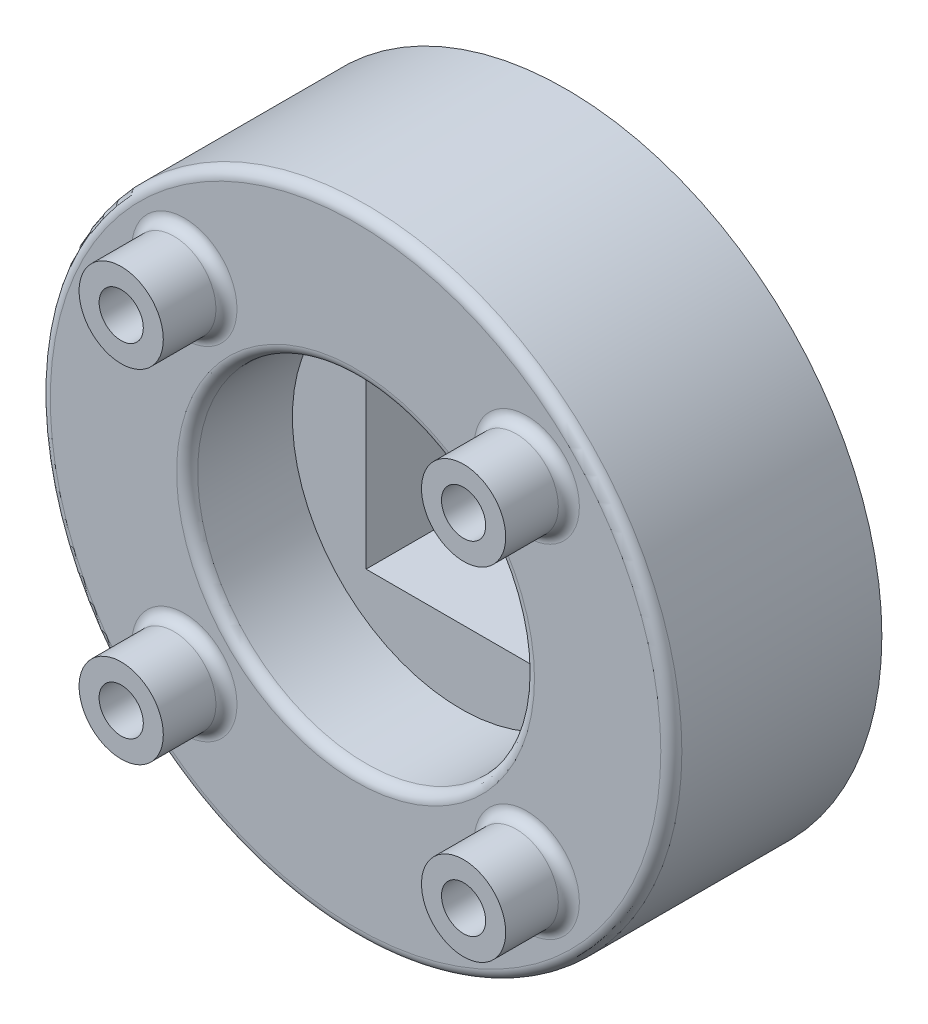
ISO-10303-21;
HEADER;
FILE_DESCRIPTION(('STEP AP214'),'2;1');
FILE_NAME('part.step','',(''),(''),'','','');
FILE_SCHEMA(('AUTOMOTIVE_DESIGN { 1 0 10303 214 1 1 1 1 }'));
ENDSEC;
DATA;
#1=APPLICATION_CONTEXT('core data for automotive mechanical design processes');
#2=APPLICATION_PROTOCOL_DEFINITION('international standard','automotive_design',2000,#1);
#3=PRODUCT_CONTEXT('',#1,'mechanical');
#4=PRODUCT('Part','Part','',(#3));
#5=PRODUCT_RELATED_PRODUCT_CATEGORY('part','',(#4));
#6=PRODUCT_DEFINITION_FORMATION('','',#4);
#7=PRODUCT_DEFINITION_CONTEXT('part definition',#1,'design');
#8=PRODUCT_DEFINITION('design','',#6,#7);
#9=PRODUCT_DEFINITION_SHAPE('','',#8);
#10=(LENGTH_UNIT() NAMED_UNIT(*) SI_UNIT(.MILLI.,.METRE.));
#11=(NAMED_UNIT(*) PLANE_ANGLE_UNIT() SI_UNIT($,.RADIAN.));
#12=(NAMED_UNIT(*) SI_UNIT($,.STERADIAN.) SOLID_ANGLE_UNIT());
#13=UNCERTAINTY_MEASURE_WITH_UNIT(LENGTH_MEASURE(1.E-05),#10,'distance_accuracy_value','');
#14=(GEOMETRIC_REPRESENTATION_CONTEXT(3) GLOBAL_UNCERTAINTY_ASSIGNED_CONTEXT((#13)) GLOBAL_UNIT_ASSIGNED_CONTEXT((#10,
#11,#12)) REPRESENTATION_CONTEXT('',''));
#15=CARTESIAN_POINT('',(0.,0.,0.));
#16=DIRECTION('',(0.,0.,1.));
#17=DIRECTION('',(1.,0.,0.));
#18=AXIS2_PLACEMENT_3D('',#15,#16,#17);
#19=CARTESIAN_POINT('',(22.5,-22.5,0.));
#20=DIRECTION('',(1.,0.,0.));
#21=DIRECTION('',(0.,0.,-1.));
#22=AXIS2_PLACEMENT_3D('',#19,#20,#21);
#23=PLANE('',#22);
#24=DIRECTION('',(0.,-1.,0.));
#25=VECTOR('',#24,1.);
#26=CARTESIAN_POINT('',(22.5,-22.5,25.));
#27=LINE('',#26,#25);
#28=CARTESIAN_POINT('',(22.5,22.5,25.));
#29=VERTEX_POINT('',#28);
#30=CARTESIAN_POINT('',(22.5,-22.5,25.));
#31=VERTEX_POINT('',#30);
#32=EDGE_CURVE('E143',#29,#31,#27,.T.);
#33=ORIENTED_EDGE('',*,*,#32,.F.);
#34=DIRECTION('',(0.,0.,1.));
#35=VECTOR('',#34,1.);
#36=CARTESIAN_POINT('',(22.5,22.5,0.));
#37=LINE('',#36,#35);
#38=CARTESIAN_POINT('',(22.5,22.5,0.));
#39=VERTEX_POINT('',#38);
#40=EDGE_CURVE('E155',#39,#29,#37,.T.);
#41=ORIENTED_EDGE('',*,*,#40,.F.);
#42=DIRECTION('',(0.,1.,0.));
#43=VECTOR('',#42,1.);
#44=CARTESIAN_POINT('',(22.5,-22.5,0.));
#45=LINE('',#44,#43);
#46=CARTESIAN_POINT('',(22.5,-22.5,0.));
#47=VERTEX_POINT('',#46);
#48=EDGE_CURVE('E145',#47,#39,#45,.T.);
#49=ORIENTED_EDGE('',*,*,#48,.F.);
#50=DIRECTION('',(0.,0.,1.));
#51=VECTOR('',#50,1.);
#52=CARTESIAN_POINT('',(22.5,-22.5,0.));
#53=LINE('',#52,#51);
#54=EDGE_CURVE('E156',#47,#31,#53,.T.);
#55=ORIENTED_EDGE('',*,*,#54,.T.);
#56=EDGE_LOOP('',(#33,#41,#49,#55));
#57=FACE_BOUND('',#56,.T.);
#58=ADVANCED_FACE('F40',(#57),#23,.F.);
#59=CARTESIAN_POINT('',(-22.5,-22.5,0.));
#60=DIRECTION('',(0.,-1.,0.));
#61=DIRECTION('',(0.,0.,-1.));
#62=AXIS2_PLACEMENT_3D('',#59,#60,#61);
#63=PLANE('',#62);
#64=DIRECTION('',(-1.,0.,0.));
#65=VECTOR('',#64,1.);
#66=CARTESIAN_POINT('',(-22.5,-22.5,25.));
#67=LINE('',#66,#65);
#68=CARTESIAN_POINT('',(-22.5,-22.5,25.));
#69=VERTEX_POINT('',#68);
#70=EDGE_CURVE('E141',#31,#69,#67,.T.);
#71=ORIENTED_EDGE('',*,*,#70,.F.);
#72=ORIENTED_EDGE('',*,*,#54,.F.);
#73=DIRECTION('',(1.,0.,0.));
#74=VECTOR('',#73,1.);
#75=CARTESIAN_POINT('',(-22.5,-22.5,0.));
#76=LINE('',#75,#74);
#77=CARTESIAN_POINT('',(-22.5,-22.5,0.));
#78=VERTEX_POINT('',#77);
#79=EDGE_CURVE('E152',#78,#47,#76,.T.);
#80=ORIENTED_EDGE('',*,*,#79,.F.);
#81=DIRECTION('',(0.,0.,1.));
#82=VECTOR('',#81,1.);
#83=CARTESIAN_POINT('',(-22.5,-22.5,0.));
#84=LINE('',#83,#82);
#85=EDGE_CURVE('E160',#78,#69,#84,.T.);
#86=ORIENTED_EDGE('',*,*,#85,.T.);
#87=EDGE_LOOP('',(#71,#72,#80,#86));
#88=FACE_BOUND('',#87,.T.);
#89=ADVANCED_FACE('F220',(#88),#63,.F.);
#90=CARTESIAN_POINT('',(-22.5,-22.5,0.));
#91=DIRECTION('',(-1.,0.,0.));
#92=DIRECTION('',(0.,0.,1.));
#93=AXIS2_PLACEMENT_3D('',#90,#91,#92);
#94=PLANE('',#93);
#95=DIRECTION('',(0.,1.,0.));
#96=VECTOR('',#95,1.);
#97=CARTESIAN_POINT('',(-22.5,-22.5,25.));
#98=LINE('',#97,#96);
#99=CARTESIAN_POINT('',(-22.5,22.5,25.));
#100=VERTEX_POINT('',#99);
#101=EDGE_CURVE('E55',#69,#100,#98,.T.);
#102=ORIENTED_EDGE('',*,*,#101,.F.);
#103=ORIENTED_EDGE('',*,*,#85,.F.);
#104=DIRECTION('',(0.,-1.,0.));
#105=VECTOR('',#104,1.);
#106=CARTESIAN_POINT('',(-22.5,-22.5,0.));
#107=LINE('',#106,#105);
#108=CARTESIAN_POINT('',(-22.5,22.5,0.));
#109=VERTEX_POINT('',#108);
#110=EDGE_CURVE('E63',#109,#78,#107,.T.);
#111=ORIENTED_EDGE('',*,*,#110,.F.);
#112=DIRECTION('',(0.,0.,1.));
#113=VECTOR('',#112,1.);
#114=CARTESIAN_POINT('',(-22.5,22.5,0.));
#115=LINE('',#114,#113);
#116=EDGE_CURVE('E163',#109,#100,#115,.T.);
#117=ORIENTED_EDGE('',*,*,#116,.T.);
#118=EDGE_LOOP('',(#102,#103,#111,#117));
#119=FACE_BOUND('',#118,.T.);
#120=ADVANCED_FACE('F226',(#119),#94,.F.);
#121=CARTESIAN_POINT('',(-22.5,22.5,0.));
#122=DIRECTION('',(0.,1.,0.));
#123=DIRECTION('',(0.,0.,1.));
#124=AXIS2_PLACEMENT_3D('',#121,#122,#123);
#125=PLANE('',#124);
#126=DIRECTION('',(1.,0.,0.));
#127=VECTOR('',#126,1.);
#128=CARTESIAN_POINT('',(-22.5,22.5,25.));
#129=LINE('',#128,#127);
#130=EDGE_CURVE('E169',#100,#29,#129,.T.);
#131=ORIENTED_EDGE('',*,*,#130,.F.);
#132=ORIENTED_EDGE('',*,*,#116,.F.);
#133=DIRECTION('',(-1.,0.,0.));
#134=VECTOR('',#133,1.);
#135=CARTESIAN_POINT('',(-22.5,22.5,0.));
#136=LINE('',#135,#134);
#137=EDGE_CURVE('E148',#39,#109,#136,.T.);
#138=ORIENTED_EDGE('',*,*,#137,.F.);
#139=ORIENTED_EDGE('',*,*,#40,.T.);
#140=EDGE_LOOP('',(#131,#132,#138,#139));
#141=FACE_BOUND('',#140,.T.);
#142=ADVANCED_FACE('F232',(#141),#125,.F.);
#143=CARTESIAN_POINT('',(0.,0.,50.));
#144=DIRECTION('',(0.,0.,-1.));
#145=DIRECTION('',(-1.,0.,0.));
#146=AXIS2_PLACEMENT_3D('',#143,#144,#145);
#147=CYLINDRICAL_SURFACE('',#146,75.);
#148=CARTESIAN_POINT('',(0.,0.,47.5));
#149=DIRECTION('',(0.,0.,1.));
#150=DIRECTION('',(1.,0.,0.));
#151=AXIS2_PLACEMENT_3D('',#148,#149,#150);
#152=CIRCLE('',#151,75.);
#153=CARTESIAN_POINT('',(75.,0.,47.5));
#154=VERTEX_POINT('',#153);
#155=EDGE_CURVE('E189',#154,#154,#152,.F.);
#156=ORIENTED_EDGE('',*,*,#155,.T.);
#157=EDGE_LOOP('',(#156));
#158=FACE_BOUND('',#157,.T.);
#159=CARTESIAN_POINT('',(0.,0.,0.));
#160=DIRECTION('',(0.,0.,1.));
#161=DIRECTION('',(1.,0.,0.));
#162=AXIS2_PLACEMENT_3D('',#159,#160,#161);
#163=CIRCLE('',#162,75.);
#164=CARTESIAN_POINT('',(75.,0.,0.));
#165=VERTEX_POINT('',#164);
#166=EDGE_CURVE('E159',#165,#165,#163,.T.);
#167=ORIENTED_EDGE('',*,*,#166,.T.);
#168=EDGE_LOOP('',(#167));
#169=FACE_BOUND('',#168,.T.);
#170=ADVANCED_FACE('F238',(#158,#169),#147,.T.);
#171=CARTESIAN_POINT('',(0.,0.,50.));
#172=DIRECTION('',(0.,0.,1.));
#173=DIRECTION('',(1.,0.,0.));
#174=AXIS2_PLACEMENT_3D('',#171,#172,#173);
#175=PLANE('',#174);
#176=CARTESIAN_POINT('',(0.,0.,50.));
#177=DIRECTION('',(0.,0.,1.));
#178=DIRECTION('',(1.,0.,0.));
#179=AXIS2_PLACEMENT_3D('',#176,#177,#178);
#180=CIRCLE('',#179,72.5);
#181=CARTESIAN_POINT('',(72.5,0.,50.));
#182=VERTEX_POINT('',#181);
#183=EDGE_CURVE('E186',#182,#182,#180,.T.);
#184=ORIENTED_EDGE('',*,*,#183,.T.);
#185=EDGE_LOOP('',(#184));
#186=FACE_BOUND('',#185,.T.);
#187=CARTESIAN_POINT('',(0.,0.,50.));
#188=DIRECTION('',(0.,0.,1.));
#189=DIRECTION('',(1.,0.,0.));
#190=AXIS2_PLACEMENT_3D('',#187,#188,#189);
#191=CIRCLE('',#190,42.5);
#192=CARTESIAN_POINT('',(42.5,0.,50.));
#193=VERTEX_POINT('',#192);
#194=EDGE_CURVE('E183',#193,#193,#191,.F.);
#195=ORIENTED_EDGE('',*,*,#194,.T.);
#196=EDGE_LOOP('',(#195));
#197=FACE_BOUND('',#196,.T.);
#198=CARTESIAN_POINT('',(-40.6586399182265,40.6586399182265,50.));
#199=DIRECTION('',(0.,0.,1.));
#200=DIRECTION('',(1.,0.,0.));
#201=AXIS2_PLACEMENT_3D('',#198,#199,#200);
#202=CIRCLE('',#201,12.5);
#203=CARTESIAN_POINT('',(-28.1586399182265,40.6586399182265,50.));
#204=VERTEX_POINT('',#203);
#205=EDGE_CURVE('E180',#204,#204,#202,.F.);
#206=ORIENTED_EDGE('',*,*,#205,.T.);
#207=EDGE_LOOP('',(#206));
#208=FACE_BOUND('',#207,.T.);
#209=CARTESIAN_POINT('',(40.6586399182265,40.6586399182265,50.));
#210=DIRECTION('',(0.,0.,1.));
#211=DIRECTION('',(1.,0.,0.));
#212=AXIS2_PLACEMENT_3D('',#209,#210,#211);
#213=CIRCLE('',#212,12.5);
#214=CARTESIAN_POINT('',(53.1586399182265,40.6586399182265,50.));
#215=VERTEX_POINT('',#214);
#216=EDGE_CURVE('E177',#215,#215,#213,.F.);
#217=ORIENTED_EDGE('',*,*,#216,.T.);
#218=EDGE_LOOP('',(#217));
#219=FACE_BOUND('',#218,.T.);
#220=CARTESIAN_POINT('',(40.6586399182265,-40.6586399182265,50.));
#221=DIRECTION('',(0.,0.,1.));
#222=DIRECTION('',(1.,0.,0.));
#223=AXIS2_PLACEMENT_3D('',#220,#221,#222);
#224=CIRCLE('',#223,12.5);
#225=CARTESIAN_POINT('',(53.1586399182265,-40.6586399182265,50.));
#226=VERTEX_POINT('',#225);
#227=EDGE_CURVE('E174',#226,#226,#224,.F.);
#228=ORIENTED_EDGE('',*,*,#227,.T.);
#229=EDGE_LOOP('',(#228));
#230=FACE_BOUND('',#229,.T.);
#231=CARTESIAN_POINT('',(-40.6586399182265,-40.6586399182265,50.));
#232=DIRECTION('',(0.,0.,1.));
#233=DIRECTION('',(1.,0.,0.));
#234=AXIS2_PLACEMENT_3D('',#231,#232,#233);
#235=CIRCLE('',#234,12.5);
#236=CARTESIAN_POINT('',(-28.1586399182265,-40.6586399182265,50.));
#237=VERTEX_POINT('',#236);
#238=EDGE_CURVE('E171',#237,#237,#235,.F.);
#239=ORIENTED_EDGE('',*,*,#238,.T.);
#240=EDGE_LOOP('',(#239));
#241=FACE_BOUND('',#240,.T.);
#242=ADVANCED_FACE('F234',(#186,#197,#208,#219,#230,#241),#175,.T.);
#243=CARTESIAN_POINT('',(0.,0.,0.));
#244=DIRECTION('',(0.,0.,1.));
#245=DIRECTION('',(1.,0.,0.));
#246=AXIS2_PLACEMENT_3D('',#243,#244,#245);
#247=PLANE('',#246);
#248=ORIENTED_EDGE('',*,*,#79,.T.);
#249=ORIENTED_EDGE('',*,*,#48,.T.);
#250=ORIENTED_EDGE('',*,*,#137,.T.);
#251=ORIENTED_EDGE('',*,*,#110,.T.);
#252=EDGE_LOOP('',(#248,#249,#250,#251));
#253=FACE_BOUND('',#252,.T.);
#254=ORIENTED_EDGE('',*,*,#166,.F.);
#255=EDGE_LOOP('',(#254));
#256=FACE_BOUND('',#255,.T.);
#257=ADVANCED_FACE('F237',(#253,#256),#247,.F.);
#258=CARTESIAN_POINT('',(0.,0.,25.));
#259=DIRECTION('',(0.,0.,1.));
#260=DIRECTION('',(1.,0.,0.));
#261=AXIS2_PLACEMENT_3D('',#258,#259,#260);
#262=PLANE('',#261);
#263=CARTESIAN_POINT('',(0.,0.,25.));
#264=DIRECTION('',(0.,0.,1.));
#265=DIRECTION('',(1.,0.,0.));
#266=AXIS2_PLACEMENT_3D('',#263,#264,#265);
#267=CIRCLE('',#266,40.);
#268=CARTESIAN_POINT('',(40.,0.,25.));
#269=VERTEX_POINT('',#268);
#270=EDGE_CURVE('E137',#269,#269,#267,.T.);
#271=ORIENTED_EDGE('',*,*,#270,.T.);
#272=EDGE_LOOP('',(#271));
#273=FACE_BOUND('',#272,.T.);
#274=ORIENTED_EDGE('',*,*,#32,.T.);
#275=ORIENTED_EDGE('',*,*,#70,.T.);
#276=ORIENTED_EDGE('',*,*,#101,.T.);
#277=ORIENTED_EDGE('',*,*,#130,.T.);
#278=EDGE_LOOP('',(#274,#275,#276,#277));
#279=FACE_BOUND('',#278,.T.);
#280=ADVANCED_FACE('F242',(#273,#279),#262,.T.);
#281=CARTESIAN_POINT('',(0.,0.,25.));
#282=DIRECTION('',(0.,0.,1.));
#283=DIRECTION('',(1.,0.,0.));
#284=AXIS2_PLACEMENT_3D('',#281,#282,#283);
#285=CYLINDRICAL_SURFACE('',#284,40.);
#286=CARTESIAN_POINT('',(0.,0.,47.5));
#287=DIRECTION('',(0.,0.,1.));
#288=DIRECTION('',(1.,0.,0.));
#289=AXIS2_PLACEMENT_3D('',#286,#287,#288);
#290=CIRCLE('',#289,40.);
#291=CARTESIAN_POINT('',(40.,0.,47.5));
#292=VERTEX_POINT('',#291);
#293=EDGE_CURVE('E192',#292,#292,#290,.T.);
#294=ORIENTED_EDGE('',*,*,#293,.T.);
#295=EDGE_LOOP('',(#294));
#296=FACE_BOUND('',#295,.T.);
#297=ORIENTED_EDGE('',*,*,#270,.F.);
#298=EDGE_LOOP('',(#297));
#299=FACE_BOUND('',#298,.T.);
#300=ADVANCED_FACE('F267',(#296,#299),#285,.F.);
#301=CARTESIAN_POINT('',(-40.6586399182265,40.6586399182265,65.));
#302=DIRECTION('',(0.,0.,-1.));
#303=DIRECTION('',(-1.,0.,0.));
#304=AXIS2_PLACEMENT_3D('',#301,#302,#303);
#305=CYLINDRICAL_SURFACE('',#304,10.);
#306=CARTESIAN_POINT('',(-40.6586399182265,40.6586399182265,52.5));
#307=DIRECTION('',(0.,0.,1.));
#308=DIRECTION('',(1.,0.,0.));
#309=AXIS2_PLACEMENT_3D('',#306,#307,#308);
#310=CIRCLE('',#309,10.);
#311=CARTESIAN_POINT('',(-30.6586399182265,40.6586399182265,52.5));
#312=VERTEX_POINT('',#311);
#313=EDGE_CURVE('E195',#312,#312,#310,.T.);
#314=ORIENTED_EDGE('',*,*,#313,.T.);
#315=EDGE_LOOP('',(#314));
#316=FACE_BOUND('',#315,.T.);
#317=CARTESIAN_POINT('',(-40.6586399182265,40.6586399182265,65.));
#318=DIRECTION('',(0.,0.,1.));
#319=DIRECTION('',(1.,0.,0.));
#320=AXIS2_PLACEMENT_3D('',#317,#318,#319);
#321=CIRCLE('',#320,10.);
#322=CARTESIAN_POINT('',(-30.6586399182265,40.6586399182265,65.));
#323=VERTEX_POINT('',#322);
#324=EDGE_CURVE('E134',#323,#323,#321,.T.);
#325=ORIENTED_EDGE('',*,*,#324,.F.);
#326=EDGE_LOOP('',(#325));
#327=FACE_BOUND('',#326,.T.);
#328=ADVANCED_FACE('F263',(#316,#327),#305,.T.);
#329=CARTESIAN_POINT('',(-40.6586399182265,40.6586399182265,65.));
#330=DIRECTION('',(0.,0.,1.));
#331=DIRECTION('',(1.,0.,0.));
#332=AXIS2_PLACEMENT_3D('',#329,#330,#331);
#333=PLANE('',#332);
#334=CARTESIAN_POINT('',(-40.6586399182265,40.6586399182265,65.));
#335=DIRECTION('',(0.,0.,1.));
#336=DIRECTION('',(1.,0.,0.));
#337=AXIS2_PLACEMENT_3D('',#334,#335,#336);
#338=CIRCLE('',#337,5.24999999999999);
#339=CARTESIAN_POINT('',(-35.4086399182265,40.6586399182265,65.));
#340=VERTEX_POINT('',#339);
#341=EDGE_CURVE('E103',#340,#340,#338,.T.);
#342=ORIENTED_EDGE('',*,*,#341,.F.);
#343=EDGE_LOOP('',(#342));
#344=FACE_BOUND('',#343,.T.);
#345=ORIENTED_EDGE('',*,*,#324,.T.);
#346=EDGE_LOOP('',(#345));
#347=FACE_BOUND('',#346,.T.);
#348=ADVANCED_FACE('F266',(#344,#347),#333,.T.);
#349=CARTESIAN_POINT('',(40.6586399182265,40.6586399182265,65.));
#350=DIRECTION('',(0.,0.,-1.));
#351=DIRECTION('',(-1.,0.,0.));
#352=AXIS2_PLACEMENT_3D('',#349,#350,#351);
#353=CYLINDRICAL_SURFACE('',#352,10.);
#354=CARTESIAN_POINT('',(40.6586399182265,40.6586399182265,52.5));
#355=DIRECTION('',(0.,0.,1.));
#356=DIRECTION('',(1.,0.,0.));
#357=AXIS2_PLACEMENT_3D('',#354,#355,#356);
#358=CIRCLE('',#357,10.);
#359=CARTESIAN_POINT('',(50.6586399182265,40.6586399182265,52.5));
#360=VERTEX_POINT('',#359);
#361=EDGE_CURVE('E198',#360,#360,#358,.T.);
#362=ORIENTED_EDGE('',*,*,#361,.T.);
#363=EDGE_LOOP('',(#362));
#364=FACE_BOUND('',#363,.T.);
#365=CARTESIAN_POINT('',(40.6586399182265,40.6586399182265,65.));
#366=DIRECTION('',(0.,0.,1.));
#367=DIRECTION('',(1.,0.,0.));
#368=AXIS2_PLACEMENT_3D('',#365,#366,#367);
#369=CIRCLE('',#368,10.);
#370=CARTESIAN_POINT('',(50.6586399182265,40.6586399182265,65.));
#371=VERTEX_POINT('',#370);
#372=EDGE_CURVE('E131',#371,#371,#369,.T.);
#373=ORIENTED_EDGE('',*,*,#372,.F.);
#374=EDGE_LOOP('',(#373));
#375=FACE_BOUND('',#374,.T.);
#376=ADVANCED_FACE('F272',(#364,#375),#353,.T.);
#377=CARTESIAN_POINT('',(40.6586399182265,40.6586399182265,65.));
#378=DIRECTION('',(0.,0.,1.));
#379=DIRECTION('',(1.,0.,0.));
#380=AXIS2_PLACEMENT_3D('',#377,#378,#379);
#381=PLANE('',#380);
#382=CARTESIAN_POINT('',(40.6586399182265,40.6586399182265,65.));
#383=DIRECTION('',(0.,0.,1.));
#384=DIRECTION('',(1.,0.,0.));
#385=AXIS2_PLACEMENT_3D('',#382,#383,#384);
#386=CIRCLE('',#385,5.24999999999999);
#387=CARTESIAN_POINT('',(45.9086399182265,40.6586399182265,65.));
#388=VERTEX_POINT('',#387);
#389=EDGE_CURVE('E102',#388,#388,#386,.T.);
#390=ORIENTED_EDGE('',*,*,#389,.F.);
#391=EDGE_LOOP('',(#390));
#392=FACE_BOUND('',#391,.T.);
#393=ORIENTED_EDGE('',*,*,#372,.T.);
#394=EDGE_LOOP('',(#393));
#395=FACE_BOUND('',#394,.T.);
#396=ADVANCED_FACE('F278',(#392,#395),#381,.T.);
#397=CARTESIAN_POINT('',(40.6586399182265,-40.6586399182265,65.));
#398=DIRECTION('',(0.,0.,-1.));
#399=DIRECTION('',(-1.,0.,0.));
#400=AXIS2_PLACEMENT_3D('',#397,#398,#399);
#401=CYLINDRICAL_SURFACE('',#400,10.);
#402=CARTESIAN_POINT('',(40.6586399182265,-40.6586399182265,52.5));
#403=DIRECTION('',(0.,0.,1.));
#404=DIRECTION('',(1.,0.,0.));
#405=AXIS2_PLACEMENT_3D('',#402,#403,#404);
#406=CIRCLE('',#405,10.);
#407=CARTESIAN_POINT('',(50.6586399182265,-40.6586399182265,52.5));
#408=VERTEX_POINT('',#407);
#409=EDGE_CURVE('E48',#408,#408,#406,.T.);
#410=ORIENTED_EDGE('',*,*,#409,.T.);
#411=EDGE_LOOP('',(#410));
#412=FACE_BOUND('',#411,.T.);
#413=CARTESIAN_POINT('',(40.6586399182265,-40.6586399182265,65.));
#414=DIRECTION('',(0.,0.,1.));
#415=DIRECTION('',(1.,0.,0.));
#416=AXIS2_PLACEMENT_3D('',#413,#414,#415);
#417=CIRCLE('',#416,10.);
#418=CARTESIAN_POINT('',(50.6586399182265,-40.6586399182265,65.));
#419=VERTEX_POINT('',#418);
#420=EDGE_CURVE('E128',#419,#419,#417,.T.);
#421=ORIENTED_EDGE('',*,*,#420,.F.);
#422=EDGE_LOOP('',(#421));
#423=FACE_BOUND('',#422,.T.);
#424=ADVANCED_FACE('F203',(#412,#423),#401,.T.);
#425=CARTESIAN_POINT('',(40.6586399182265,-40.6586399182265,65.));
#426=DIRECTION('',(0.,0.,1.));
#427=DIRECTION('',(1.,0.,0.));
#428=AXIS2_PLACEMENT_3D('',#425,#426,#427);
#429=PLANE('',#428);
#430=CARTESIAN_POINT('',(40.6586399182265,-40.6586399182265,65.));
#431=DIRECTION('',(0.,0.,1.));
#432=DIRECTION('',(1.,0.,0.));
#433=AXIS2_PLACEMENT_3D('',#430,#431,#432);
#434=CIRCLE('',#433,5.24999999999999);
#435=CARTESIAN_POINT('',(45.9086399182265,-40.6586399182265,65.));
#436=VERTEX_POINT('',#435);
#437=EDGE_CURVE('E113',#436,#436,#434,.T.);
#438=ORIENTED_EDGE('',*,*,#437,.F.);
#439=EDGE_LOOP('',(#438));
#440=FACE_BOUND('',#439,.T.);
#441=ORIENTED_EDGE('',*,*,#420,.T.);
#442=EDGE_LOOP('',(#441));
#443=FACE_BOUND('',#442,.T.);
#444=ADVANCED_FACE('F346',(#440,#443),#429,.T.);
#445=CARTESIAN_POINT('',(-40.6586399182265,-40.6586399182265,65.));
#446=DIRECTION('',(0.,0.,-1.));
#447=DIRECTION('',(-1.,0.,0.));
#448=AXIS2_PLACEMENT_3D('',#445,#446,#447);
#449=CYLINDRICAL_SURFACE('',#448,10.);
#450=CARTESIAN_POINT('',(-40.6586399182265,-40.6586399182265,52.5));
#451=DIRECTION('',(0.,0.,1.));
#452=DIRECTION('',(1.,0.,0.));
#453=AXIS2_PLACEMENT_3D('',#450,#451,#452);
#454=CIRCLE('',#453,10.);
#455=CARTESIAN_POINT('',(-30.6586399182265,-40.6586399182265,52.5));
#456=VERTEX_POINT('',#455);
#457=EDGE_CURVE('E11',#456,#456,#454,.T.);
#458=ORIENTED_EDGE('',*,*,#457,.T.);
#459=EDGE_LOOP('',(#458));
#460=FACE_BOUND('',#459,.T.);
#461=CARTESIAN_POINT('',(-40.6586399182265,-40.6586399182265,65.));
#462=DIRECTION('',(0.,0.,1.));
#463=DIRECTION('',(1.,0.,0.));
#464=AXIS2_PLACEMENT_3D('',#461,#462,#463);
#465=CIRCLE('',#464,10.);
#466=CARTESIAN_POINT('',(-30.6586399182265,-40.6586399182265,65.));
#467=VERTEX_POINT('',#466);
#468=EDGE_CURVE('E125',#467,#467,#465,.T.);
#469=ORIENTED_EDGE('',*,*,#468,.F.);
#470=EDGE_LOOP('',(#469));
#471=FACE_BOUND('',#470,.T.);
#472=ADVANCED_FACE('F353',(#460,#471),#449,.T.);
#473=CARTESIAN_POINT('',(-40.6586399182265,-40.6586399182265,65.));
#474=DIRECTION('',(0.,0.,1.));
#475=DIRECTION('',(1.,0.,0.));
#476=AXIS2_PLACEMENT_3D('',#473,#474,#475);
#477=PLANE('',#476);
#478=CARTESIAN_POINT('',(-40.6586399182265,-40.6586399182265,65.));
#479=DIRECTION('',(0.,0.,1.));
#480=DIRECTION('',(1.,0.,0.));
#481=AXIS2_PLACEMENT_3D('',#478,#479,#480);
#482=CIRCLE('',#481,5.24999999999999);
#483=CARTESIAN_POINT('',(-35.4086399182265,-40.6586399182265,65.));
#484=VERTEX_POINT('',#483);
#485=EDGE_CURVE('E119',#484,#484,#482,.T.);
#486=ORIENTED_EDGE('',*,*,#485,.F.);
#487=EDGE_LOOP('',(#486));
#488=FACE_BOUND('',#487,.T.);
#489=ORIENTED_EDGE('',*,*,#468,.T.);
#490=EDGE_LOOP('',(#489));
#491=FACE_BOUND('',#490,.T.);
#492=ADVANCED_FACE('F358',(#488,#491),#477,.T.);
#493=CARTESIAN_POINT('',(-40.6586399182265,-40.6586399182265,33.5));
#494=DIRECTION('',(0.,0.,1.));
#495=DIRECTION('',(1.,0.,0.));
#496=AXIS2_PLACEMENT_3D('',#493,#494,#495);
#497=CONICAL_SURFACE('',#496,5.24999999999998,1.02974425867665);
#498=CARTESIAN_POINT('',(-40.6586399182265,-40.6586399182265,30.3454817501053));
#499=VERTEX_POINT('',#498);
#500=VERTEX_LOOP('',#499);
#501=FACE_BOUND('',#500,.T.);
#502=CARTESIAN_POINT('',(-40.6586399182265,-40.6586399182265,33.5));
#503=DIRECTION('',(0.,0.,1.));
#504=DIRECTION('',(1.,0.,0.));
#505=AXIS2_PLACEMENT_3D('',#502,#503,#504);
#506=CIRCLE('',#505,5.24999999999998);
#507=CARTESIAN_POINT('',(-35.4086399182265,-40.6586399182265,33.5));
#508=VERTEX_POINT('',#507);
#509=EDGE_CURVE('E122',#508,#508,#506,.T.);
#510=ORIENTED_EDGE('',*,*,#509,.T.);
#511=EDGE_LOOP('',(#510));
#512=FACE_BOUND('',#511,.T.);
#513=ADVANCED_FACE('F447',(#501,#512),#497,.F.);
#514=CARTESIAN_POINT('',(-40.6586399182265,-40.6586399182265,65.));
#515=DIRECTION('',(0.,0.,1.));
#516=DIRECTION('',(1.,0.,0.));
#517=AXIS2_PLACEMENT_3D('',#514,#515,#516);
#518=CYLINDRICAL_SURFACE('',#517,5.24999999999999);
#519=ORIENTED_EDGE('',*,*,#509,.F.);
#520=EDGE_LOOP('',(#519));
#521=FACE_BOUND('',#520,.T.);
#522=ORIENTED_EDGE('',*,*,#485,.T.);
#523=EDGE_LOOP('',(#522));
#524=FACE_BOUND('',#523,.T.);
#525=ADVANCED_FACE('F439',(#521,#524),#518,.F.);
#526=CARTESIAN_POINT('',(40.6586399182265,-40.6586399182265,33.5));
#527=DIRECTION('',(0.,0.,1.));
#528=DIRECTION('',(1.,0.,0.));
#529=AXIS2_PLACEMENT_3D('',#526,#527,#528);
#530=CONICAL_SURFACE('',#529,5.24999999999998,1.02974425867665);
#531=CARTESIAN_POINT('',(40.6586399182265,-40.6586399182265,30.3454817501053));
#532=VERTEX_POINT('',#531);
#533=VERTEX_LOOP('',#532);
#534=FACE_BOUND('',#533,.T.);
#535=CARTESIAN_POINT('',(40.6586399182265,-40.6586399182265,33.5));
#536=DIRECTION('',(0.,0.,1.));
#537=DIRECTION('',(1.,0.,0.));
#538=AXIS2_PLACEMENT_3D('',#535,#536,#537);
#539=CIRCLE('',#538,5.24999999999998);
#540=CARTESIAN_POINT('',(45.9086399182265,-40.6586399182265,33.5));
#541=VERTEX_POINT('',#540);
#542=EDGE_CURVE('E116',#541,#541,#539,.T.);
#543=ORIENTED_EDGE('',*,*,#542,.T.);
#544=EDGE_LOOP('',(#543));
#545=FACE_BOUND('',#544,.T.);
#546=ADVANCED_FACE('F430',(#534,#545),#530,.F.);
#547=CARTESIAN_POINT('',(40.6586399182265,-40.6586399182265,65.));
#548=DIRECTION('',(0.,0.,1.));
#549=DIRECTION('',(1.,0.,0.));
#550=AXIS2_PLACEMENT_3D('',#547,#548,#549);
#551=CYLINDRICAL_SURFACE('',#550,5.24999999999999);
#552=ORIENTED_EDGE('',*,*,#542,.F.);
#553=EDGE_LOOP('',(#552));
#554=FACE_BOUND('',#553,.T.);
#555=ORIENTED_EDGE('',*,*,#437,.T.);
#556=EDGE_LOOP('',(#555));
#557=FACE_BOUND('',#556,.T.);
#558=ADVANCED_FACE('F422',(#554,#557),#551,.F.);
#559=CARTESIAN_POINT('',(40.6586399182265,40.6586399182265,33.5));
#560=DIRECTION('',(0.,0.,1.));
#561=DIRECTION('',(1.,0.,0.));
#562=AXIS2_PLACEMENT_3D('',#559,#560,#561);
#563=CONICAL_SURFACE('',#562,5.24999999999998,1.02974425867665);
#564=CARTESIAN_POINT('',(40.6586399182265,40.6586399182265,30.3454817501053));
#565=VERTEX_POINT('',#564);
#566=VERTEX_LOOP('',#565);
#567=FACE_BOUND('',#566,.T.);
#568=CARTESIAN_POINT('',(40.6586399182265,40.6586399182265,33.5));
#569=DIRECTION('',(0.,0.,1.));
#570=DIRECTION('',(1.,0.,0.));
#571=AXIS2_PLACEMENT_3D('',#568,#569,#570);
#572=CIRCLE('',#571,5.24999999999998);
#573=CARTESIAN_POINT('',(45.9086399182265,40.6586399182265,33.5));
#574=VERTEX_POINT('',#573);
#575=EDGE_CURVE('E106',#574,#574,#572,.T.);
#576=ORIENTED_EDGE('',*,*,#575,.T.);
#577=EDGE_LOOP('',(#576));
#578=FACE_BOUND('',#577,.T.);
#579=ADVANCED_FACE('F413',(#567,#578),#563,.F.);
#580=CARTESIAN_POINT('',(40.6586399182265,40.6586399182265,65.));
#581=DIRECTION('',(0.,0.,1.));
#582=DIRECTION('',(1.,0.,0.));
#583=AXIS2_PLACEMENT_3D('',#580,#581,#582);
#584=CYLINDRICAL_SURFACE('',#583,5.24999999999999);
#585=ORIENTED_EDGE('',*,*,#575,.F.);
#586=EDGE_LOOP('',(#585));
#587=FACE_BOUND('',#586,.T.);
#588=ORIENTED_EDGE('',*,*,#389,.T.);
#589=EDGE_LOOP('',(#588));
#590=FACE_BOUND('',#589,.T.);
#591=ADVANCED_FACE('F96',(#587,#590),#584,.F.);
#592=CARTESIAN_POINT('',(-40.6586399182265,40.6586399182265,33.5));
#593=DIRECTION('',(0.,0.,1.));
#594=DIRECTION('',(1.,0.,0.));
#595=AXIS2_PLACEMENT_3D('',#592,#593,#594);
#596=CONICAL_SURFACE('',#595,5.24999999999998,1.02974425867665);
#597=CARTESIAN_POINT('',(-40.6586399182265,40.6586399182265,30.3454817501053));
#598=VERTEX_POINT('',#597);
#599=VERTEX_LOOP('',#598);
#600=FACE_BOUND('',#599,.T.);
#601=CARTESIAN_POINT('',(-40.6586399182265,40.6586399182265,33.5));
#602=DIRECTION('',(0.,0.,1.));
#603=DIRECTION('',(1.,0.,0.));
#604=AXIS2_PLACEMENT_3D('',#601,#602,#603);
#605=CIRCLE('',#604,5.24999999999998);
#606=CARTESIAN_POINT('',(-35.4086399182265,40.6586399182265,33.5));
#607=VERTEX_POINT('',#606);
#608=EDGE_CURVE('E100',#607,#607,#605,.T.);
#609=ORIENTED_EDGE('',*,*,#608,.T.);
#610=EDGE_LOOP('',(#609));
#611=FACE_BOUND('',#610,.T.);
#612=ADVANCED_FACE('F92',(#600,#611),#596,.F.);
#613=CARTESIAN_POINT('',(-40.6586399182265,40.6586399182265,65.));
#614=DIRECTION('',(0.,0.,1.));
#615=DIRECTION('',(1.,0.,0.));
#616=AXIS2_PLACEMENT_3D('',#613,#614,#615);
#617=CYLINDRICAL_SURFACE('',#616,5.24999999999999);
#618=ORIENTED_EDGE('',*,*,#608,.F.);
#619=EDGE_LOOP('',(#618));
#620=FACE_BOUND('',#619,.T.);
#621=ORIENTED_EDGE('',*,*,#341,.T.);
#622=EDGE_LOOP('',(#621));
#623=FACE_BOUND('',#622,.T.);
#624=ADVANCED_FACE('F95',(#620,#623),#617,.F.);
#625=CARTESIAN_POINT('',(0.,0.,47.5));
#626=DIRECTION('',(0.,0.,1.));
#627=DIRECTION('',(1.,0.,0.));
#628=AXIS2_PLACEMENT_3D('',#625,#626,#627);
#629=TOROIDAL_SURFACE('',#628,72.5,2.5);
#630=ORIENTED_EDGE('',*,*,#155,.F.);
#631=EDGE_LOOP('',(#630));
#632=FACE_BOUND('',#631,.T.);
#633=ORIENTED_EDGE('',*,*,#183,.F.);
#634=EDGE_LOOP('',(#633));
#635=FACE_BOUND('',#634,.T.);
#636=ADVANCED_FACE('F247',(#632,#635),#629,.T.);
#637=CARTESIAN_POINT('',(0.,0.,47.5));
#638=DIRECTION('',(0.,0.,1.));
#639=DIRECTION('',(1.,0.,0.));
#640=AXIS2_PLACEMENT_3D('',#637,#638,#639);
#641=TOROIDAL_SURFACE('',#640,42.5,2.5);
#642=ORIENTED_EDGE('',*,*,#194,.F.);
#643=EDGE_LOOP('',(#642));
#644=FACE_BOUND('',#643,.T.);
#645=ORIENTED_EDGE('',*,*,#293,.F.);
#646=EDGE_LOOP('',(#645));
#647=FACE_BOUND('',#646,.T.);
#648=ADVANCED_FACE('F250',(#644,#647),#641,.T.);
#649=CARTESIAN_POINT('',(-40.6586399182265,40.6586399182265,52.5));
#650=DIRECTION('',(0.,0.,1.));
#651=DIRECTION('',(1.,0.,0.));
#652=AXIS2_PLACEMENT_3D('',#649,#650,#651);
#653=TOROIDAL_SURFACE('',#652,12.5,2.5);
#654=ORIENTED_EDGE('',*,*,#205,.F.);
#655=EDGE_LOOP('',(#654));
#656=FACE_BOUND('',#655,.T.);
#657=ORIENTED_EDGE('',*,*,#313,.F.);
#658=EDGE_LOOP('',(#657));
#659=FACE_BOUND('',#658,.T.);
#660=ADVANCED_FACE('F215',(#656,#659),#653,.F.);
#661=CARTESIAN_POINT('',(40.6586399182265,40.6586399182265,52.5));
#662=DIRECTION('',(0.,0.,1.));
#663=DIRECTION('',(1.,0.,0.));
#664=AXIS2_PLACEMENT_3D('',#661,#662,#663);
#665=TOROIDAL_SURFACE('',#664,12.5,2.5);
#666=ORIENTED_EDGE('',*,*,#216,.F.);
#667=EDGE_LOOP('',(#666));
#668=FACE_BOUND('',#667,.T.);
#669=ORIENTED_EDGE('',*,*,#361,.F.);
#670=EDGE_LOOP('',(#669));
#671=FACE_BOUND('',#670,.T.);
#672=ADVANCED_FACE('F208',(#668,#671),#665,.F.);
#673=CARTESIAN_POINT('',(40.6586399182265,-40.6586399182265,52.5));
#674=DIRECTION('',(0.,0.,1.));
#675=DIRECTION('',(1.,0.,0.));
#676=AXIS2_PLACEMENT_3D('',#673,#674,#675);
#677=TOROIDAL_SURFACE('',#676,12.5,2.5);
#678=ORIENTED_EDGE('',*,*,#227,.F.);
#679=EDGE_LOOP('',(#678));
#680=FACE_BOUND('',#679,.T.);
#681=ORIENTED_EDGE('',*,*,#409,.F.);
#682=EDGE_LOOP('',(#681));
#683=FACE_BOUND('',#682,.T.);
#684=ADVANCED_FACE('F206',(#680,#683),#677,.F.);
#685=CARTESIAN_POINT('',(-40.6586399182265,-40.6586399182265,52.5));
#686=DIRECTION('',(0.,0.,1.));
#687=DIRECTION('',(1.,0.,0.));
#688=AXIS2_PLACEMENT_3D('',#685,#686,#687);
#689=TOROIDAL_SURFACE('',#688,12.5,2.5);
#690=ORIENTED_EDGE('',*,*,#238,.F.);
#691=EDGE_LOOP('',(#690));
#692=FACE_BOUND('',#691,.T.);
#693=ORIENTED_EDGE('',*,*,#457,.F.);
#694=EDGE_LOOP('',(#693));
#695=FACE_BOUND('',#694,.T.);
#696=ADVANCED_FACE('F42',(#692,#695),#689,.F.);
#697=CLOSED_SHELL('',(#58,#89,#120,#142,#170,#242,#257,#280,#300,#328,#348,#376,#396,#424,#444,
#472,#492,#513,#525,#546,#558,#579,#591,#612,#624,#636,#648,#660,#672,#684,#696));
#698=MANIFOLD_SOLID_BREP('B2',#697);
#699=ADVANCED_BREP_SHAPE_REPRESENTATION('',(#18,#698),#14);
#700=SHAPE_DEFINITION_REPRESENTATION(#9,#699);
ENDSEC;
END-ISO-10303-21;
